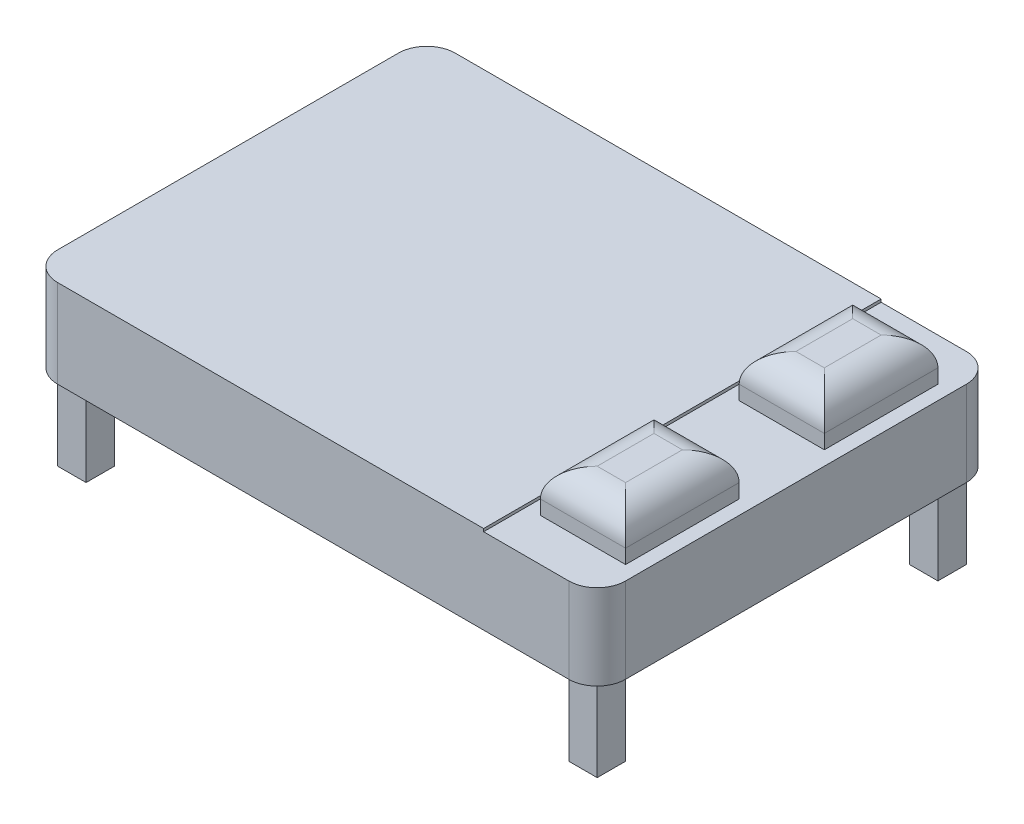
from build123d import *

# Parameters (mm, degrees)
ESQUISSE1_W               = 2000
ESQUISSE1_H               = 1400
BOSS_EXTRU_1_DEPTH        = 300
ESQUISSE2_W               = 100
ESQUISSE2_H               = 100
BOSS_EXTRU_2_DEPTH        = 300
SYM_TRIE2_COPY_1_SKETCH_W = 100
SYM_TRIE2_COPY_1_SKETCH_H = 100
SYM_TRIE2_COPY_1_DEPTH    = 300
ESQUISSE3_W               = 1600
ESQUISSE3_H               = 1400
BOSS_EXTRU_3_DEPTH        = 10
ESQUISSE4_W               = 300
ESQUISSE4_H               = 400
BOSS_EXTRU_4_DEPTH        = 150
CONG_1_R                  = 100
CONG_2_R                  = 100


with BuildPart() as part:
    # Esquisse1 → Boss.-Extru.1 (new body)
    with BuildSketch(Plane(origin=(0, 0, 0), x_dir=(1, 0, 0), z_dir=(0, 1, 0))):
        Rectangle(ESQUISSE1_W, ESQUISSE1_H)
    extrude(amount=BOSS_EXTRU_1_DEPTH)

    # Esquisse2 → Boss.-Extru.2 (add)
    with BuildSketch(Plane.XZ):
        with Locations((-900, 600)):
            Rectangle(ESQUISSE2_W, ESQUISSE2_H)
    boss_extru_2 = extrude(amount=BOSS_EXTRU_2_DEPTH)

    # Sym_trie1: Boss.-Extru.2 across plane
    add(boss_extru_2.mirror(Plane.XY))

    # Sym_trie2: Boss.-Extru.2 across plane
    add(boss_extru_2.mirror(Plane(origin=(0, 0, 0), x_dir=(0, 0, 1), z_dir=(1, 0, 0))))

    # Sym_trie2 copy 1 sketch → Sym_trie2 copy 1 (add)
    with BuildSketch(Plane(origin=(0, 0, 0), x_dir=(-1, 0, 0), z_dir=(0, -1, 0))):
        with Locations((-900, 600)):
            Rectangle(SYM_TRIE2_COPY_1_SKETCH_W, SYM_TRIE2_COPY_1_SKETCH_H)
    extrude(amount=SYM_TRIE2_COPY_1_DEPTH)

    # Esquisse3 → Boss.-Extru.3 (add)
    with BuildSketch(Plane(origin=(0, 300, 0), x_dir=(1, 0, 0), z_dir=(0, 1, 0))):
        with Locations((-200, 0)):
            Rectangle(ESQUISSE3_W, ESQUISSE3_H)
    extrude(amount=BOSS_EXTRU_3_DEPTH)

    # Esquisse4 → Boss.-Extru.4 (add)
    with BuildSketch(Plane(origin=(0, 300, 0), x_dir=(1, 0, 0), z_dir=(0, 1, 0))):
        with Locations((800, 350)):
            Rectangle(ESQUISSE4_W, ESQUISSE4_H)
        with Locations((800, -350)):
            Rectangle(ESQUISSE4_W, ESQUISSE4_H)
    extrude(amount=BOSS_EXTRU_4_DEPTH)

    # Cong_1
    cong_1_edges = [part.edges().sort_by_distance(p)[0] for p in [
        (650, 450, -350),
        (800, 450, -150),
        (950, 450, -350),
        (800, 450, -550),
        (650, 450, 350),
        (800, 450, 550),
        (950, 450, 350),
        (800, 450, 150),
    ]]
    fillet(cong_1_edges, radius=CONG_1_R)

    # Cong_2
    cong_2_edges = [part.edges().sort_by_distance(p)[0] for p in [
        (1000, 150, -700),
        (-1000, 155, -700),
        (1000, 150, 700),
        (-1000, 155, 700),
    ]]
    fillet(cong_2_edges, radius=CONG_2_R)


solid = part.part
